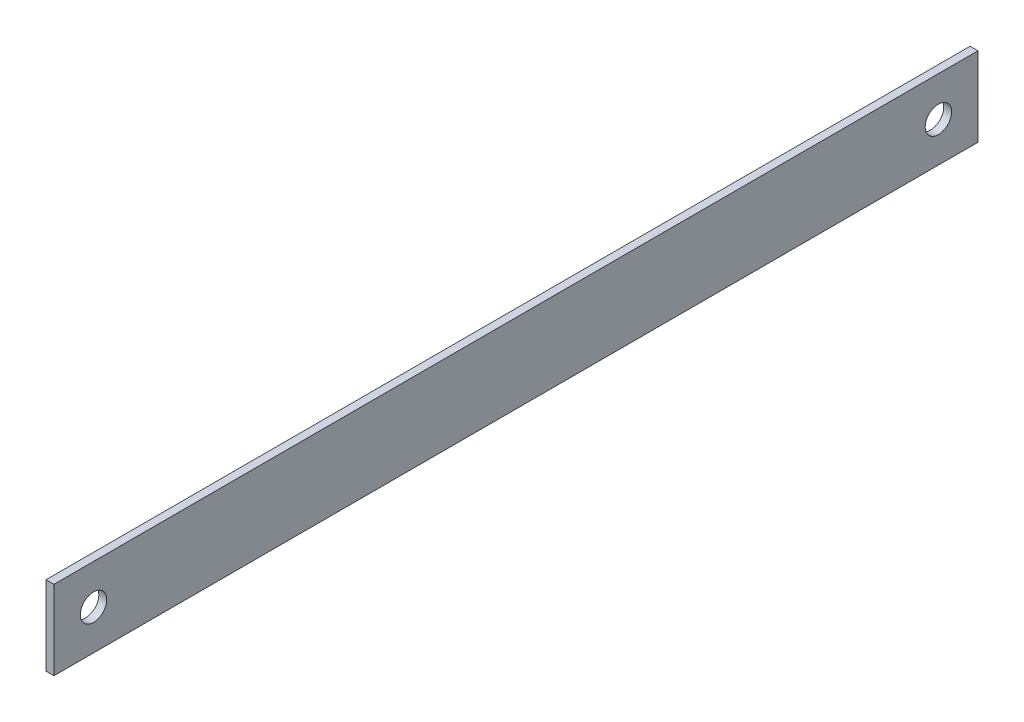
ISO-10303-21;
HEADER;
FILE_DESCRIPTION(('STEP AP214'),'2;1');
FILE_NAME('part.step','',(''),(''),'','','');
FILE_SCHEMA(('AUTOMOTIVE_DESIGN { 1 0 10303 214 1 1 1 1 }'));
ENDSEC;
DATA;
#1=APPLICATION_CONTEXT('core data for automotive mechanical design processes');
#2=APPLICATION_PROTOCOL_DEFINITION('international standard','automotive_design',2000,#1);
#3=PRODUCT_CONTEXT('',#1,'mechanical');
#4=PRODUCT('Part','Part','',(#3));
#5=PRODUCT_RELATED_PRODUCT_CATEGORY('part','',(#4));
#6=PRODUCT_DEFINITION_FORMATION('','',#4);
#7=PRODUCT_DEFINITION_CONTEXT('part definition',#1,'design');
#8=PRODUCT_DEFINITION('design','',#6,#7);
#9=PRODUCT_DEFINITION_SHAPE('','',#8);
#10=(LENGTH_UNIT() NAMED_UNIT(*) SI_UNIT(.MILLI.,.METRE.));
#11=(NAMED_UNIT(*) PLANE_ANGLE_UNIT() SI_UNIT($,.RADIAN.));
#12=(NAMED_UNIT(*) SI_UNIT($,.STERADIAN.) SOLID_ANGLE_UNIT());
#13=UNCERTAINTY_MEASURE_WITH_UNIT(LENGTH_MEASURE(1.E-05),#10,'distance_accuracy_value','');
#14=(GEOMETRIC_REPRESENTATION_CONTEXT(3) GLOBAL_UNCERTAINTY_ASSIGNED_CONTEXT((#13)) GLOBAL_UNIT_ASSIGNED_CONTEXT((#10,
#11,#12)) REPRESENTATION_CONTEXT('',''));
#15=CARTESIAN_POINT('',(0.,0.,0.));
#16=DIRECTION('',(0.,0.,1.));
#17=DIRECTION('',(1.,0.,0.));
#18=AXIS2_PLACEMENT_3D('',#15,#16,#17);
#19=CARTESIAN_POINT('',(1.5,15.,-175.));
#20=DIRECTION('',(0.,0.,1.));
#21=DIRECTION('',(1.,0.,0.));
#22=AXIS2_PLACEMENT_3D('',#19,#20,#21);
#23=PLANE('',#22);
#24=DIRECTION('',(0.,1.,0.));
#25=VECTOR('',#24,1.);
#26=CARTESIAN_POINT('',(-1.5,15.,-175.));
#27=LINE('',#26,#25);
#28=CARTESIAN_POINT('',(-1.5,-15.,-175.));
#29=VERTEX_POINT('',#28);
#30=CARTESIAN_POINT('',(-1.5,15.,-175.));
#31=VERTEX_POINT('',#30);
#32=EDGE_CURVE('E110',#29,#31,#27,.T.);
#33=ORIENTED_EDGE('',*,*,#32,.T.);
#34=DIRECTION('',(-1.,0.,0.));
#35=VECTOR('',#34,1.);
#36=CARTESIAN_POINT('',(1.5,15.,-175.));
#37=LINE('',#36,#35);
#38=CARTESIAN_POINT('',(1.5,15.,-175.));
#39=VERTEX_POINT('',#38);
#40=EDGE_CURVE('E11',#39,#31,#37,.T.);
#41=ORIENTED_EDGE('',*,*,#40,.F.);
#42=DIRECTION('',(0.,1.,0.));
#43=VECTOR('',#42,1.);
#44=CARTESIAN_POINT('',(1.5,15.,-175.));
#45=LINE('',#44,#43);
#46=CARTESIAN_POINT('',(1.5,-15.,-175.));
#47=VERTEX_POINT('',#46);
#48=EDGE_CURVE('E93',#47,#39,#45,.T.);
#49=ORIENTED_EDGE('',*,*,#48,.F.);
#50=DIRECTION('',(-1.,0.,0.));
#51=VECTOR('',#50,1.);
#52=CARTESIAN_POINT('',(1.5,-15.,-175.));
#53=LINE('',#52,#51);
#54=EDGE_CURVE('E106',#47,#29,#53,.T.);
#55=ORIENTED_EDGE('',*,*,#54,.T.);
#56=EDGE_LOOP('',(#33,#41,#49,#55));
#57=FACE_BOUND('',#56,.T.);
#58=ADVANCED_FACE('F39',(#57),#23,.F.);
#59=CARTESIAN_POINT('',(1.5,15.,175.));
#60=DIRECTION('',(0.,-1.,0.));
#61=DIRECTION('',(0.,0.,-1.));
#62=AXIS2_PLACEMENT_3D('',#59,#60,#61);
#63=PLANE('',#62);
#64=DIRECTION('',(0.,0.,1.));
#65=VECTOR('',#64,1.);
#66=CARTESIAN_POINT('',(-1.5,15.,175.));
#67=LINE('',#66,#65);
#68=CARTESIAN_POINT('',(-1.5,15.,175.));
#69=VERTEX_POINT('',#68);
#70=EDGE_CURVE('E98',#31,#69,#67,.T.);
#71=ORIENTED_EDGE('',*,*,#70,.T.);
#72=DIRECTION('',(-1.,0.,0.));
#73=VECTOR('',#72,1.);
#74=CARTESIAN_POINT('',(1.5,15.,175.));
#75=LINE('',#74,#73);
#76=CARTESIAN_POINT('',(1.5,15.,175.));
#77=VERTEX_POINT('',#76);
#78=EDGE_CURVE('E49',#77,#69,#75,.T.);
#79=ORIENTED_EDGE('',*,*,#78,.F.);
#80=DIRECTION('',(0.,0.,1.));
#81=VECTOR('',#80,1.);
#82=CARTESIAN_POINT('',(1.5,15.,175.));
#83=LINE('',#82,#81);
#84=EDGE_CURVE('E88',#39,#77,#83,.T.);
#85=ORIENTED_EDGE('',*,*,#84,.F.);
#86=ORIENTED_EDGE('',*,*,#40,.T.);
#87=EDGE_LOOP('',(#71,#79,#85,#86));
#88=FACE_BOUND('',#87,.T.);
#89=ADVANCED_FACE('F97',(#88),#63,.F.);
#90=CARTESIAN_POINT('',(1.5,15.,175.));
#91=DIRECTION('',(0.,0.,-1.));
#92=DIRECTION('',(-1.,0.,0.));
#93=AXIS2_PLACEMENT_3D('',#90,#91,#92);
#94=PLANE('',#93);
#95=DIRECTION('',(0.,-1.,0.));
#96=VECTOR('',#95,1.);
#97=CARTESIAN_POINT('',(-1.5,15.,175.));
#98=LINE('',#97,#96);
#99=CARTESIAN_POINT('',(-1.5,-15.,175.));
#100=VERTEX_POINT('',#99);
#101=EDGE_CURVE('E75',#69,#100,#98,.T.);
#102=ORIENTED_EDGE('',*,*,#101,.T.);
#103=DIRECTION('',(-1.,0.,0.));
#104=VECTOR('',#103,1.);
#105=CARTESIAN_POINT('',(1.5,-15.,175.));
#106=LINE('',#105,#104);
#107=CARTESIAN_POINT('',(1.5,-15.,175.));
#108=VERTEX_POINT('',#107);
#109=EDGE_CURVE('E100',#108,#100,#106,.T.);
#110=ORIENTED_EDGE('',*,*,#109,.F.);
#111=DIRECTION('',(0.,-1.,0.));
#112=VECTOR('',#111,1.);
#113=CARTESIAN_POINT('',(1.5,15.,175.));
#114=LINE('',#113,#112);
#115=EDGE_CURVE('E91',#77,#108,#114,.T.);
#116=ORIENTED_EDGE('',*,*,#115,.F.);
#117=ORIENTED_EDGE('',*,*,#78,.T.);
#118=EDGE_LOOP('',(#102,#110,#116,#117));
#119=FACE_BOUND('',#118,.T.);
#120=ADVANCED_FACE('F102',(#119),#94,.F.);
#121=CARTESIAN_POINT('',(1.5,-15.,175.));
#122=DIRECTION('',(0.,1.,0.));
#123=DIRECTION('',(0.,0.,1.));
#124=AXIS2_PLACEMENT_3D('',#121,#122,#123);
#125=PLANE('',#124);
#126=DIRECTION('',(0.,0.,-1.));
#127=VECTOR('',#126,1.);
#128=CARTESIAN_POINT('',(-1.5,-15.,175.));
#129=LINE('',#128,#127);
#130=EDGE_CURVE('E81',#100,#29,#129,.T.);
#131=ORIENTED_EDGE('',*,*,#130,.T.);
#132=ORIENTED_EDGE('',*,*,#54,.F.);
#133=DIRECTION('',(0.,0.,-1.));
#134=VECTOR('',#133,1.);
#135=CARTESIAN_POINT('',(1.5,-15.,175.));
#136=LINE('',#135,#134);
#137=EDGE_CURVE('E58',#108,#47,#136,.T.);
#138=ORIENTED_EDGE('',*,*,#137,.F.);
#139=ORIENTED_EDGE('',*,*,#109,.T.);
#140=EDGE_LOOP('',(#131,#132,#138,#139));
#141=FACE_BOUND('',#140,.T.);
#142=ADVANCED_FACE('F148',(#141),#125,.F.);
#143=CARTESIAN_POINT('',(1.5,0.,0.));
#144=DIRECTION('',(1.,0.,0.));
#145=DIRECTION('',(0.,0.,-1.));
#146=AXIS2_PLACEMENT_3D('',#143,#144,#145);
#147=PLANE('',#146);
#148=CARTESIAN_POINT('',(1.5,0.,160.));
#149=DIRECTION('',(1.,0.,0.));
#150=DIRECTION('',(0.,0.,-1.));
#151=AXIS2_PLACEMENT_3D('',#148,#149,#150);
#152=CIRCLE('',#151,4.99999999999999);
#153=CARTESIAN_POINT('',(1.5,0.,155.));
#154=VERTEX_POINT('',#153);
#155=EDGE_CURVE('E126',#154,#154,#152,.T.);
#156=ORIENTED_EDGE('',*,*,#155,.F.);
#157=EDGE_LOOP('',(#156));
#158=FACE_BOUND('',#157,.T.);
#159=CARTESIAN_POINT('',(1.5,0.,-160.));
#160=DIRECTION('',(1.,0.,0.));
#161=DIRECTION('',(0.,0.,-1.));
#162=AXIS2_PLACEMENT_3D('',#159,#160,#161);
#163=CIRCLE('',#162,4.99999999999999);
#164=CARTESIAN_POINT('',(1.5,0.,-165.));
#165=VERTEX_POINT('',#164);
#166=EDGE_CURVE('E133',#165,#165,#163,.T.);
#167=ORIENTED_EDGE('',*,*,#166,.F.);
#168=EDGE_LOOP('',(#167));
#169=FACE_BOUND('',#168,.T.);
#170=ORIENTED_EDGE('',*,*,#48,.T.);
#171=ORIENTED_EDGE('',*,*,#84,.T.);
#172=ORIENTED_EDGE('',*,*,#115,.T.);
#173=ORIENTED_EDGE('',*,*,#137,.T.);
#174=EDGE_LOOP('',(#170,#171,#172,#173));
#175=FACE_BOUND('',#174,.T.);
#176=ADVANCED_FACE('F89',(#158,#169,#175),#147,.T.);
#177=CARTESIAN_POINT('',(-1.5,0.,0.));
#178=DIRECTION('',(1.,0.,0.));
#179=DIRECTION('',(0.,0.,-1.));
#180=AXIS2_PLACEMENT_3D('',#177,#178,#179);
#181=PLANE('',#180);
#182=CARTESIAN_POINT('',(-1.5,0.,160.));
#183=DIRECTION('',(1.,0.,0.));
#184=DIRECTION('',(0.,0.,-1.));
#185=AXIS2_PLACEMENT_3D('',#182,#183,#184);
#186=CIRCLE('',#185,4.99999999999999);
#187=CARTESIAN_POINT('',(-1.5,0.,155.));
#188=VERTEX_POINT('',#187);
#189=EDGE_CURVE('E42',#188,#188,#186,.T.);
#190=ORIENTED_EDGE('',*,*,#189,.T.);
#191=EDGE_LOOP('',(#190));
#192=FACE_BOUND('',#191,.T.);
#193=CARTESIAN_POINT('',(-1.5,0.,-160.));
#194=DIRECTION('',(1.,0.,0.));
#195=DIRECTION('',(0.,0.,-1.));
#196=AXIS2_PLACEMENT_3D('',#193,#194,#195);
#197=CIRCLE('',#196,4.99999999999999);
#198=CARTESIAN_POINT('',(-1.5,0.,-165.));
#199=VERTEX_POINT('',#198);
#200=EDGE_CURVE('E123',#199,#199,#197,.T.);
#201=ORIENTED_EDGE('',*,*,#200,.T.);
#202=EDGE_LOOP('',(#201));
#203=FACE_BOUND('',#202,.T.);
#204=ORIENTED_EDGE('',*,*,#32,.F.);
#205=ORIENTED_EDGE('',*,*,#130,.F.);
#206=ORIENTED_EDGE('',*,*,#101,.F.);
#207=ORIENTED_EDGE('',*,*,#70,.F.);
#208=EDGE_LOOP('',(#204,#205,#206,#207));
#209=FACE_BOUND('',#208,.T.);
#210=ADVANCED_FACE('F147',(#192,#203,#209),#181,.F.);
#211=CARTESIAN_POINT('',(-3.5,0.,-160.));
#212=DIRECTION('',(1.,0.,0.));
#213=DIRECTION('',(0.,0.,-1.));
#214=AXIS2_PLACEMENT_3D('',#211,#212,#213);
#215=CYLINDRICAL_SURFACE('',#214,4.99999999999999);
#216=ORIENTED_EDGE('',*,*,#166,.T.);
#217=EDGE_LOOP('',(#216));
#218=FACE_BOUND('',#217,.T.);
#219=ORIENTED_EDGE('',*,*,#200,.F.);
#220=EDGE_LOOP('',(#219));
#221=FACE_BOUND('',#220,.T.);
#222=ADVANCED_FACE('F143',(#218,#221),#215,.F.);
#223=CARTESIAN_POINT('',(-3.5,0.,160.));
#224=DIRECTION('',(1.,0.,0.));
#225=DIRECTION('',(0.,0.,-1.));
#226=AXIS2_PLACEMENT_3D('',#223,#224,#225);
#227=CYLINDRICAL_SURFACE('',#226,4.99999999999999);
#228=ORIENTED_EDGE('',*,*,#155,.T.);
#229=EDGE_LOOP('',(#228));
#230=FACE_BOUND('',#229,.T.);
#231=ORIENTED_EDGE('',*,*,#189,.F.);
#232=EDGE_LOOP('',(#231));
#233=FACE_BOUND('',#232,.T.);
#234=ADVANCED_FACE('F195',(#230,#233),#227,.F.);
#235=CLOSED_SHELL('',(#58,#89,#120,#142,#176,#210,#222,#234));
#236=MANIFOLD_SOLID_BREP('B2',#235);
#237=ADVANCED_BREP_SHAPE_REPRESENTATION('',(#18,#236),#14);
#238=SHAPE_DEFINITION_REPRESENTATION(#9,#237);
ENDSEC;
END-ISO-10303-21;
